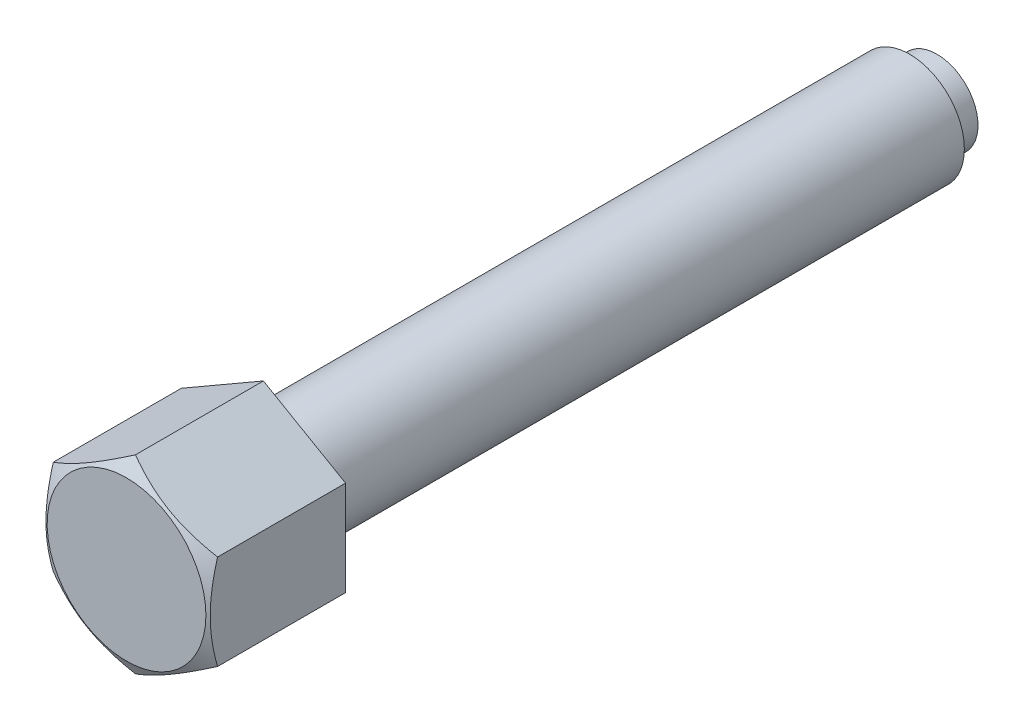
ISO-10303-21;
HEADER;
FILE_DESCRIPTION(('STEP AP214'),'2;1');
FILE_NAME('part.step','',(''),(''),'','','');
FILE_SCHEMA(('AUTOMOTIVE_DESIGN { 1 0 10303 214 1 1 1 1 }'));
ENDSEC;
DATA;
#1=APPLICATION_CONTEXT('core data for automotive mechanical design processes');
#2=APPLICATION_PROTOCOL_DEFINITION('international standard','automotive_design',2000,#1);
#3=PRODUCT_CONTEXT('',#1,'mechanical');
#4=PRODUCT('Part','Part','',(#3));
#5=PRODUCT_RELATED_PRODUCT_CATEGORY('part','',(#4));
#6=PRODUCT_DEFINITION_FORMATION('','',#4);
#7=PRODUCT_DEFINITION_CONTEXT('part definition',#1,'design');
#8=PRODUCT_DEFINITION('design','',#6,#7);
#9=PRODUCT_DEFINITION_SHAPE('','',#8);
#10=(LENGTH_UNIT() NAMED_UNIT(*) SI_UNIT(.MILLI.,.METRE.));
#11=(NAMED_UNIT(*) PLANE_ANGLE_UNIT() SI_UNIT($,.RADIAN.));
#12=(NAMED_UNIT(*) SI_UNIT($,.STERADIAN.) SOLID_ANGLE_UNIT());
#13=UNCERTAINTY_MEASURE_WITH_UNIT(LENGTH_MEASURE(1.E-05),#10,'distance_accuracy_value','');
#14=(GEOMETRIC_REPRESENTATION_CONTEXT(3) GLOBAL_UNCERTAINTY_ASSIGNED_CONTEXT((#13)) GLOBAL_UNIT_ASSIGNED_CONTEXT((#10,
#11,#12)) REPRESENTATION_CONTEXT('',''));
#15=CARTESIAN_POINT('',(0.,0.,0.));
#16=DIRECTION('',(0.,0.,1.));
#17=DIRECTION('',(1.,0.,0.));
#18=AXIS2_PLACEMENT_3D('',#15,#16,#17);
#19=CARTESIAN_POINT('',(0.,17.3205080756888,120.));
#20=DIRECTION('',(-0.5,-0.86602540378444,0.));
#21=DIRECTION('',(0.86602540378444,-0.5,0.));
#22=AXIS2_PLACEMENT_3D('',#19,#20,#21);
#23=PLANE('',#22);
#24=CARTESIAN_POINT('',(15.0002,8.66013856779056,148.371512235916));
#25=CARTESIAN_POINT('',(14.6705058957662,8.85048754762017,148.481403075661));
#26=CARTESIAN_POINT('',(14.3395258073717,9.04157899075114,148.586307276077));
#27=CARTESIAN_POINT('',(13.674911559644,9.425294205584,148.784756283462));
#28=CARTESIAN_POINT('',(13.3412765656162,9.61791845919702,148.878297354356));
#29=CARTESIAN_POINT('',(12.6707077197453,10.0050715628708,149.052762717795));
#30=CARTESIAN_POINT('',(12.333767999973,10.199603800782,149.133657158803));
#31=CARTESIAN_POINT('',(11.6575472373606,10.5900200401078,149.281092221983));
#32=CARTESIAN_POINT('',(11.3182663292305,10.7859039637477,149.347633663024));
#33=CARTESIAN_POINT('',(10.6460568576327,11.1740042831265,149.463532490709));
#34=CARTESIAN_POINT('',(10.3131781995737,11.3661918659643,149.513273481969));
#35=CARTESIAN_POINT('',(9.6458955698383,11.7514476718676,149.596678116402));
#36=CARTESIAN_POINT('',(9.31149156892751,11.9445159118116,149.630341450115));
#37=CARTESIAN_POINT('',(8.64212181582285,12.3309767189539,149.680740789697));
#38=CARTESIAN_POINT('',(8.30715720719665,12.5243686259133,149.697496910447));
#39=CARTESIAN_POINT('',(7.636918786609,12.9113309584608,149.713721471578));
#40=CARTESIAN_POINT('',(7.30164498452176,13.1049013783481,149.713190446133));
#41=CARTESIAN_POINT('',(6.67485311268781,13.4667798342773,149.696048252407));
#42=CARTESIAN_POINT('',(6.38329037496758,13.6351136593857,149.681528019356));
#43=CARTESIAN_POINT('',(5.80083556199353,13.9713941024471,149.639687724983));
#44=CARTESIAN_POINT('',(5.50994353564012,14.1393406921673,149.612366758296));
#45=CARTESIAN_POINT('',(4.92898814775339,14.4747554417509,149.545401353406));
#46=CARTESIAN_POINT('',(4.63892567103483,14.6422230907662,149.505746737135));
#47=CARTESIAN_POINT('',(4.06016058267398,14.9763732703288,149.414809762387));
#48=CARTESIAN_POINT('',(3.77145806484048,15.1430557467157,149.363526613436));
#49=CARTESIAN_POINT('',(2.89508556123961,15.6490296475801,149.190938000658));
#50=CARTESIAN_POINT('',(2.30995340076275,15.9868558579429,149.052423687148));
#51=CARTESIAN_POINT('',(1.14841408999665,16.657470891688,148.73805289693));
#52=CARTESIAN_POINT('',(0.5719920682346,16.9902683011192,148.562270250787));
#53=CARTESIAN_POINT('',(-0.00019999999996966,17.3206235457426,148.371512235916));
#54=B_SPLINE_CURVE_WITH_KNOTS('',3,(#24,#25,#26,#27,#28,#29,#30,#31,#32,#33,#34,#35,#36,#37,#38,
#39,#40,#41,#42,#43,#44,#45,#46,#47,#48,#49,#50,#51,#52,#53),.UNSPECIFIED.,.F.,.F.,(4,2,2,2,2,2,
2,2,2,2,2,2,2,2,4),(0.,1.18875411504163,2.37789802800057,3.56980778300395,4.76164951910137,
5.9240737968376,7.08652044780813,8.24758247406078,9.40860862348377,10.4193068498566,
11.4300765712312,12.4416826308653,13.4533574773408,15.5211962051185,17.5849760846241),.UNSPECIFIED.);
#55=CARTESIAN_POINT('',(15.,8.66025403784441,148.37157890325));
#56=VERTEX_POINT('',#55);
#57=CARTESIAN_POINT('',(0.,17.3205080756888,148.37157890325));
#58=VERTEX_POINT('',#57);
#59=EDGE_CURVE('E30',#56,#58,#54,.T.);
#60=ORIENTED_EDGE('',*,*,#59,.F.);
#61=DIRECTION('',(0.,0.,1.));
#62=VECTOR('',#61,1.);
#63=CARTESIAN_POINT('',(15.,8.66025403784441,120.));
#64=LINE('',#63,#62);
#65=CARTESIAN_POINT('',(15.,8.66025403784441,125.));
#66=VERTEX_POINT('',#65);
#67=EDGE_CURVE('E97',#66,#56,#64,.T.);
#68=ORIENTED_EDGE('',*,*,#67,.F.);
#69=DIRECTION('',(0.86602540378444,-0.5,0.));
#70=VECTOR('',#69,1.);
#71=CARTESIAN_POINT('',(15.,8.66025403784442,125.));
#72=LINE('',#71,#70);
#73=CARTESIAN_POINT('',(0.,17.3205080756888,125.));
#74=VERTEX_POINT('',#73);
#75=EDGE_CURVE('E111',#74,#66,#72,.T.);
#76=ORIENTED_EDGE('',*,*,#75,.F.);
#77=DIRECTION('',(0.,0.,1.));
#78=VECTOR('',#77,1.);
#79=CARTESIAN_POINT('',(0.,17.3205080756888,120.));
#80=LINE('',#79,#78);
#81=EDGE_CURVE('E37',#74,#58,#80,.T.);
#82=ORIENTED_EDGE('',*,*,#81,.T.);
#83=EDGE_LOOP('',(#60,#68,#76,#82));
#84=FACE_BOUND('',#83,.T.);
#85=ADVANCED_FACE('F15',(#84),#23,.F.);
#86=CARTESIAN_POINT('',(15.,8.66025403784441,120.));
#87=DIRECTION('',(-1.,0.,0.));
#88=DIRECTION('',(0.,-1.,0.));
#89=AXIS2_PLACEMENT_3D('',#86,#87,#88);
#90=PLANE('',#89);
#91=CARTESIAN_POINT('',(15.,-23.2589774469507,142.392634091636));
#92=CARTESIAN_POINT('',(15.,-22.9314293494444,142.551557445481));
#93=CARTESIAN_POINT('',(15.,-22.6034967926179,142.709688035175));
#94=CARTESIAN_POINT('',(15.,-21.9467825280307,143.024184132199));
#95=CARTESIAN_POINT('',(15.,-21.6180008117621,143.180549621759));
#96=CARTESIAN_POINT('',(15.,-20.6301739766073,143.646770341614));
#97=CARTESIAN_POINT('',(15.,-19.9697441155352,143.953702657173));
#98=CARTESIAN_POINT('',(15.,-18.6408678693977,144.559569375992));
#99=CARTESIAN_POINT('',(15.,-17.9723974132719,144.85845110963));
#100=CARTESIAN_POINT('',(15.,-16.6301391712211,145.443983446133));
#101=CARTESIAN_POINT('',(15.,-15.9563516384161,145.730634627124));
#102=CARTESIAN_POINT('',(15.,-14.5806535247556,146.297423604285));
#103=CARTESIAN_POINT('',(15.,-13.8785342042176,146.577057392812));
#104=CARTESIAN_POINT('',(15.,-12.4660749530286,147.115153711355));
#105=CARTESIAN_POINT('',(15.,-11.7557341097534,147.373613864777));
#106=CARTESIAN_POINT('',(15.,-10.3270555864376,147.862571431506));
#107=CARTESIAN_POINT('',(15.,-9.60873744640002,148.093125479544));
#108=CARTESIAN_POINT('',(15.,-8.16172910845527,148.518883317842));
#109=CARTESIAN_POINT('',(15.,-7.43304225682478,148.714098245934));
#110=CARTESIAN_POINT('',(15.,-6.33412285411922,148.972817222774));
#111=CARTESIAN_POINT('',(15.,-5.96783993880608,149.053200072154));
#112=CARTESIAN_POINT('',(15.,-5.23277197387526,149.20163973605));
#113=CARTESIAN_POINT('',(15.,-4.86398697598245,149.269696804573));
#114=CARTESIAN_POINT('',(15.,-4.12416838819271,149.392283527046));
#115=CARTESIAN_POINT('',(15.,-3.75313482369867,149.446813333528));
#116=CARTESIAN_POINT('',(15.,-3.0092152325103,149.541257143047));
#117=CARTESIAN_POINT('',(15.,-2.63632928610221,149.58117177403));
#118=CARTESIAN_POINT('',(15.,-1.8940909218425,149.645092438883));
#119=CARTESIAN_POINT('',(15.,-1.52475590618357,149.669299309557));
#120=CARTESIAN_POINT('',(15.,-0.785393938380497,149.702073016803));
#121=CARTESIAN_POINT('',(15.,-0.415366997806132,149.710640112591));
#122=CARTESIAN_POINT('',(15.,0.324718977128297,149.711930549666));
#123=CARTESIAN_POINT('',(15.,0.694778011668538,149.704653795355));
#124=CARTESIAN_POINT('',(15.,1.43425976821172,149.674433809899));
#125=CARTESIAN_POINT('',(15.,1.80368246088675,149.651489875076));
#126=CARTESIAN_POINT('',(15.,2.69161519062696,149.577999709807));
#127=CARTESIAN_POINT('',(15.,3.20952036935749,149.520014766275));
#128=CARTESIAN_POINT('',(15.,4.2414878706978,149.376411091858));
#129=CARTESIAN_POINT('',(15.,4.75554966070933,149.290788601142));
#130=CARTESIAN_POINT('',(15.,5.77933964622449,149.094955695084));
#131=CARTESIAN_POINT('',(15.,6.28906414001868,148.984726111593));
#132=CARTESIAN_POINT('',(15.,7.30340039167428,148.743042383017));
#133=CARTESIAN_POINT('',(15.,7.8080122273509,148.611588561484));
#134=CARTESIAN_POINT('',(15.,8.82323884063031,148.327542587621));
#135=CARTESIAN_POINT('',(15.,9.33374019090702,148.174547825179));
#136=CARTESIAN_POINT('',(15.,10.3497136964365,147.852767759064));
#137=CARTESIAN_POINT('',(15.,10.8551858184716,147.683982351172));
#138=CARTESIAN_POINT('',(15.,11.8613512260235,147.3332995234));
#139=CARTESIAN_POINT('',(15.,12.3620460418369,147.151406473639));
#140=CARTESIAN_POINT('',(15.,13.3592876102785,146.776646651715));
#141=CARTESIAN_POINT('',(15.,13.8558344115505,146.583780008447));
#142=CARTESIAN_POINT('',(15.,15.0279164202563,146.115990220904));
#143=CARTESIAN_POINT('',(15.,15.7018504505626,145.83706123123));
#144=CARTESIAN_POINT('',(15.,17.0439869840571,145.265699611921));
#145=CARTESIAN_POINT('',(15.,17.7121891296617,144.97326614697));
#146=CARTESIAN_POINT('',(15.,19.0439312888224,144.377603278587));
#147=CARTESIAN_POINT('',(15.,19.7074702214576,144.074371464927));
#148=CARTESIAN_POINT('',(15.,21.0305158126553,143.459292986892));
#149=CARTESIAN_POINT('',(15.,21.6900225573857,143.147446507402));
#150=CARTESIAN_POINT('',(15.,23.0063955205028,142.516405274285));
#151=CARTESIAN_POINT('',(15.,23.6632580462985,142.197202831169));
#152=CARTESIAN_POINT('',(15.,24.9741522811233,141.553038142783));
#153=CARTESIAN_POINT('',(15.,25.628183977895,141.228075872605));
#154=CARTESIAN_POINT('',(15.,26.9337675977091,140.573422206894));
#155=CARTESIAN_POINT('',(15.,27.5853198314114,140.24373143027));
#156=CARTESIAN_POINT('',(15.,28.8863878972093,139.580353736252));
#157=CARTESIAN_POINT('',(15.,29.5359037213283,139.24666680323));
#158=CARTESIAN_POINT('',(15.,31.3728578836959,138.296921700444));
#159=CARTESIAN_POINT('',(15.,32.5582518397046,137.676909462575));
#160=CARTESIAN_POINT('',(15.,34.9246422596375,136.428467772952));
#161=CARTESIAN_POINT('',(15.,36.1056385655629,135.800038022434));
#162=CARTESIAN_POINT('',(15.,38.4612393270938,134.538309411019));
#163=CARTESIAN_POINT('',(15.,39.6358523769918,133.905026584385));
#164=CARTESIAN_POINT('',(15.,41.3956981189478,132.95135677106));
#165=CARTESIAN_POINT('',(15.,41.981951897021,132.632851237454));
#166=CARTESIAN_POINT('',(15.,43.1538464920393,131.99471655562));
#167=CARTESIAN_POINT('',(15.,43.7394873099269,131.675087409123));
#168=CARTESIAN_POINT('',(15.,44.3248563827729,131.354961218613));
#169=B_SPLINE_CURVE_WITH_KNOTS('',3,(#91,#92,#93,#94,#95,#96,#97,#98,#99,#100,#101,#102,#103,
#104,#105,#106,#107,#108,#109,#110,#111,#112,#113,#114,#115,#116,#117,#118,#119,#120,#121,#122,
#123,#124,#125,#126,#127,#128,#129,#130,#131,#132,#133,#134,#135,#136,#137,#138,#139,#140,#141,
#142,#143,#144,#145,#146,#147,#148,#149,#150,#151,#152,#153,#154,#155,#156,#157,#158,#159,#160,
#161,#162,#163,#164,#165,#166,#167,#168),.UNSPECIFIED.,.F.,.F.,(4,2,2,2,2,2,2,2,2,2,2,2,2,2,2,2,
2,2,2,2,2,2,2,2,2,2,2,2,2,2,2,2,2,2,2,2,2,2,4),(0.,1.09219740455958,2.18440579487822,
4.36914598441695,6.56578614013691,8.76232234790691,11.0293285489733,13.2965888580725,
15.5591677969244,17.8210323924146,18.9458568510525,20.0706581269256,21.1954467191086,
22.3201869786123,23.4302473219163,24.5402892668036,25.6503379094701,26.7604364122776,
28.3229950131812,29.8857662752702,31.4497591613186,33.0137282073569,34.6122259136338,
36.2107341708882,37.80871192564,39.406670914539,41.5945970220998,43.7826586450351,
45.9712117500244,48.1597179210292,50.3506261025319,52.5415437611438,54.7321772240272,
56.9228192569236,60.9360168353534,64.9493572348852,68.9526974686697,70.9542593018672,
72.9558180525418),.UNSPECIFIED.);
#170=CARTESIAN_POINT('',(15.,-8.66025403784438,148.37157890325));
#171=VERTEX_POINT('',#170);
#172=EDGE_CURVE('E157',#171,#56,#169,.T.);
#173=ORIENTED_EDGE('',*,*,#172,.F.);
#174=DIRECTION('',(0.,0.,1.));
#175=VECTOR('',#174,1.);
#176=CARTESIAN_POINT('',(15.,-8.66025403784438,120.));
#177=LINE('',#176,#175);
#178=CARTESIAN_POINT('',(15.,-8.66025403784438,125.));
#179=VERTEX_POINT('',#178);
#180=EDGE_CURVE('E94',#179,#171,#177,.T.);
#181=ORIENTED_EDGE('',*,*,#180,.F.);
#182=DIRECTION('',(0.,-1.,0.));
#183=VECTOR('',#182,1.);
#184=CARTESIAN_POINT('',(15.,0.,125.));
#185=LINE('',#184,#183);
#186=EDGE_CURVE('E108',#66,#179,#185,.T.);
#187=ORIENTED_EDGE('',*,*,#186,.F.);
#188=ORIENTED_EDGE('',*,*,#67,.T.);
#189=EDGE_LOOP('',(#173,#181,#187,#188));
#190=FACE_BOUND('',#189,.T.);
#191=ADVANCED_FACE('F137',(#190),#90,.F.);
#192=CARTESIAN_POINT('',(0.,-17.3205080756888,120.));
#193=DIRECTION('',(0.5,-0.866025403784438,0.));
#194=DIRECTION('',(0.866025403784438,0.5,0.));
#195=AXIS2_PLACEMENT_3D('',#192,#193,#194);
#196=PLANE('',#195);
#197=ORIENTED_EDGE('',*,*,#180,.T.);
#198=CARTESIAN_POINT('',(15.0002,-8.66013856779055,148.371512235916));
#199=CARTESIAN_POINT('',(14.6705058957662,-8.85048754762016,148.481403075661));
#200=CARTESIAN_POINT('',(14.3395258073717,-9.04157899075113,148.586307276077));
#201=CARTESIAN_POINT('',(13.674911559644,-9.42529420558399,148.784756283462));
#202=CARTESIAN_POINT('',(13.3412765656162,-9.61791845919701,148.878297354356));
#203=CARTESIAN_POINT('',(12.6707077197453,-10.0050715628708,149.052762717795));
#204=CARTESIAN_POINT('',(12.333767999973,-10.199603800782,149.133657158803));
#205=CARTESIAN_POINT('',(11.6575472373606,-10.5900200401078,149.281092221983));
#206=CARTESIAN_POINT('',(11.3182663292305,-10.7859039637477,149.347633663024));
#207=CARTESIAN_POINT('',(10.6460568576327,-11.1740042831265,149.463532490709));
#208=CARTESIAN_POINT('',(10.3131781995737,-11.3661918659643,149.513273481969));
#209=CARTESIAN_POINT('',(9.64589556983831,-11.7514476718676,149.596678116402));
#210=CARTESIAN_POINT('',(9.31149156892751,-11.9445159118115,149.630341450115));
#211=CARTESIAN_POINT('',(8.64212181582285,-12.3309767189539,149.680740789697));
#212=CARTESIAN_POINT('',(8.30715720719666,-12.5243686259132,149.697496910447));
#213=CARTESIAN_POINT('',(7.636918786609,-12.9113309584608,149.713721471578));
#214=CARTESIAN_POINT('',(7.30164498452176,-13.104901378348,149.713190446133));
#215=CARTESIAN_POINT('',(6.6748531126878,-13.4667798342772,149.696048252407));
#216=CARTESIAN_POINT('',(6.38329037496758,-13.6351136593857,149.681528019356));
#217=CARTESIAN_POINT('',(5.80083556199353,-13.9713941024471,149.639687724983));
#218=CARTESIAN_POINT('',(5.50994353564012,-14.1393406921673,149.612366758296));
#219=CARTESIAN_POINT('',(4.92898814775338,-14.4747554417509,149.545401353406));
#220=CARTESIAN_POINT('',(4.63892567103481,-14.6422230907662,149.505746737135));
#221=CARTESIAN_POINT('',(4.06016058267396,-14.9763732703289,149.414809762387));
#222=CARTESIAN_POINT('',(3.77145806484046,-15.1430557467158,149.363526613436));
#223=CARTESIAN_POINT('',(2.89508556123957,-15.6490296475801,149.190938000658));
#224=CARTESIAN_POINT('',(2.30995340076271,-15.9868558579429,149.052423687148));
#225=CARTESIAN_POINT('',(1.14841408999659,-16.6574708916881,148.73805289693));
#226=CARTESIAN_POINT('',(0.571992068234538,-16.9902683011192,148.562270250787));
#227=CARTESIAN_POINT('',(-0.000200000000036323,-17.3206235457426,148.371512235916));
#228=B_SPLINE_CURVE_WITH_KNOTS('',3,(#198,#199,#200,#201,#202,#203,#204,#205,#206,#207,#208,
#209,#210,#211,#212,#213,#214,#215,#216,#217,#218,#219,#220,#221,#222,#223,#224,#225,#226,#227),
.UNSPECIFIED.,.F.,.F.,(4,2,2,2,2,2,2,2,2,2,2,2,2,2,4),(0.,1.18875411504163,2.37789802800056,
3.56980778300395,4.76164951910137,5.92407379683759,7.08652044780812,8.24758247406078,
9.40860862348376,10.4193068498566,11.4300765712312,12.4416826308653,13.4533574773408,
15.5211962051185,17.5849760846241),.UNSPECIFIED.);
#229=CARTESIAN_POINT('',(0.,-17.3205080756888,148.37157890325));
#230=VERTEX_POINT('',#229);
#231=EDGE_CURVE('E163',#171,#230,#228,.T.);
#232=ORIENTED_EDGE('',*,*,#231,.T.);
#233=DIRECTION('',(0.,0.,1.));
#234=VECTOR('',#233,1.);
#235=CARTESIAN_POINT('',(0.,-17.3205080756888,120.));
#236=LINE('',#235,#234);
#237=CARTESIAN_POINT('',(0.,-17.3205080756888,125.));
#238=VERTEX_POINT('',#237);
#239=EDGE_CURVE('E87',#238,#230,#236,.T.);
#240=ORIENTED_EDGE('',*,*,#239,.F.);
#241=DIRECTION('',(0.866025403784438,0.5,0.));
#242=VECTOR('',#241,1.);
#243=CARTESIAN_POINT('',(15.,-8.66025403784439,125.));
#244=LINE('',#243,#242);
#245=EDGE_CURVE('E106',#238,#179,#244,.T.);
#246=ORIENTED_EDGE('',*,*,#245,.T.);
#247=EDGE_LOOP('',(#197,#232,#240,#246));
#248=FACE_BOUND('',#247,.T.);
#249=ADVANCED_FACE('F143',(#248),#196,.T.);
#250=CARTESIAN_POINT('',(0.,-17.3205080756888,120.));
#251=DIRECTION('',(0.5,0.866025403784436,0.));
#252=DIRECTION('',(-0.866025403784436,0.5,0.));
#253=AXIS2_PLACEMENT_3D('',#250,#251,#252);
#254=PLANE('',#253);
#255=CARTESIAN_POINT('',(-15.0002,-8.66013856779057,148.371512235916));
#256=CARTESIAN_POINT('',(-14.6705058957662,-8.85048754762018,148.481403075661));
#257=CARTESIAN_POINT('',(-14.3395258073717,-9.04157899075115,148.586307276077));
#258=CARTESIAN_POINT('',(-13.674911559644,-9.42529420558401,148.784756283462));
#259=CARTESIAN_POINT('',(-13.3412765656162,-9.61791845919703,148.878297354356));
#260=CARTESIAN_POINT('',(-12.6707077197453,-10.0050715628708,149.052762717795));
#261=CARTESIAN_POINT('',(-12.333767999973,-10.199603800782,149.133657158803));
#262=CARTESIAN_POINT('',(-11.6575472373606,-10.5900200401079,149.281092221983));
#263=CARTESIAN_POINT('',(-11.3182663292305,-10.7859039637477,149.347633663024));
#264=CARTESIAN_POINT('',(-10.6460568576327,-11.1740042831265,149.463532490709));
#265=CARTESIAN_POINT('',(-10.3131781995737,-11.3661918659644,149.513273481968));
#266=CARTESIAN_POINT('',(-9.64589556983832,-11.7514476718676,149.596678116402));
#267=CARTESIAN_POINT('',(-9.31149156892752,-11.9445159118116,149.630341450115));
#268=CARTESIAN_POINT('',(-8.64212181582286,-12.3309767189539,149.680740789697));
#269=CARTESIAN_POINT('',(-8.30715720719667,-12.5243686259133,149.697496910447));
#270=CARTESIAN_POINT('',(-7.63691878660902,-12.9113309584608,149.713721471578));
#271=CARTESIAN_POINT('',(-7.30164498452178,-13.1049013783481,149.713190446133));
#272=CARTESIAN_POINT('',(-6.67485311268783,-13.4667798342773,149.696048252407));
#273=CARTESIAN_POINT('',(-6.38329037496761,-13.6351136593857,149.681528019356));
#274=CARTESIAN_POINT('',(-5.80083556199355,-13.9713941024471,149.639687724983));
#275=CARTESIAN_POINT('',(-5.50994353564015,-14.1393406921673,149.612366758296));
#276=CARTESIAN_POINT('',(-4.92898814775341,-14.4747554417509,149.545401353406));
#277=CARTESIAN_POINT('',(-4.63892567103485,-14.6422230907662,149.505746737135));
#278=CARTESIAN_POINT('',(-4.060160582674,-14.9763732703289,149.414809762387));
#279=CARTESIAN_POINT('',(-3.7714580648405,-15.1430557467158,149.363526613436));
#280=CARTESIAN_POINT('',(-2.89508556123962,-15.6490296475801,149.190938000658));
#281=CARTESIAN_POINT('',(-2.30995340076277,-15.9868558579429,149.052423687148));
#282=CARTESIAN_POINT('',(-1.14841408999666,-16.6574708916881,148.73805289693));
#283=CARTESIAN_POINT('',(-0.571992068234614,-16.9902683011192,148.562270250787));
#284=CARTESIAN_POINT('',(0.000199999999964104,-17.3206235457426,148.371512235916));
#285=B_SPLINE_CURVE_WITH_KNOTS('',3,(#255,#256,#257,#258,#259,#260,#261,#262,#263,#264,#265,
#266,#267,#268,#269,#270,#271,#272,#273,#274,#275,#276,#277,#278,#279,#280,#281,#282,#283,#284),
.UNSPECIFIED.,.F.,.F.,(4,2,2,2,2,2,2,2,2,2,2,2,2,2,4),(0.,1.18875411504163,2.37789802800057,
3.56980778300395,4.76164951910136,5.92407379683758,7.08652044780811,8.24758247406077,
9.40860862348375,10.4193068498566,11.4300765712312,12.4416826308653,13.4533574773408,
15.5211962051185,17.5849760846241),.UNSPECIFIED.);
#286=CARTESIAN_POINT('',(-15.,-8.66025403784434,148.37157890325));
#287=VERTEX_POINT('',#286);
#288=EDGE_CURVE('E81',#287,#230,#285,.T.);
#289=ORIENTED_EDGE('',*,*,#288,.F.);
#290=DIRECTION('',(0.,0.,1.));
#291=VECTOR('',#290,1.);
#292=CARTESIAN_POINT('',(-15.,-8.66025403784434,120.));
#293=LINE('',#292,#291);
#294=CARTESIAN_POINT('',(-15.,-8.66025403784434,125.));
#295=VERTEX_POINT('',#294);
#296=EDGE_CURVE('E80',#295,#287,#293,.T.);
#297=ORIENTED_EDGE('',*,*,#296,.F.);
#298=DIRECTION('',(-0.866025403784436,0.5,0.));
#299=VECTOR('',#298,1.);
#300=CARTESIAN_POINT('',(-1.17961196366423E-13,-17.3205080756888,125.));
#301=LINE('',#300,#299);
#302=EDGE_CURVE('E103',#238,#295,#301,.T.);
#303=ORIENTED_EDGE('',*,*,#302,.F.);
#304=ORIENTED_EDGE('',*,*,#239,.T.);
#305=EDGE_LOOP('',(#289,#297,#303,#304));
#306=FACE_BOUND('',#305,.T.);
#307=ADVANCED_FACE('F239',(#306),#254,.F.);
#308=CARTESIAN_POINT('',(-15.,8.66025403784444,120.));
#309=DIRECTION('',(-1.,0.,0.));
#310=DIRECTION('',(0.,0.,1.));
#311=AXIS2_PLACEMENT_3D('',#308,#309,#310);
#312=PLANE('',#311);
#313=ORIENTED_EDGE('',*,*,#296,.T.);
#314=CARTESIAN_POINT('',(-15.,-23.2589774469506,142.392634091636));
#315=CARTESIAN_POINT('',(-15.,-22.9314293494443,142.551557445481));
#316=CARTESIAN_POINT('',(-15.,-22.6034967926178,142.709688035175));
#317=CARTESIAN_POINT('',(-15.,-21.9467825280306,143.024184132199));
#318=CARTESIAN_POINT('',(-15.,-21.618000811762,143.180549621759));
#319=CARTESIAN_POINT('',(-15.,-20.6301739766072,143.646770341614));
#320=CARTESIAN_POINT('',(-15.,-19.9697441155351,143.953702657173));
#321=CARTESIAN_POINT('',(-15.,-18.6408678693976,144.559569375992));
#322=CARTESIAN_POINT('',(-15.,-17.9723974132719,144.85845110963));
#323=CARTESIAN_POINT('',(-15.,-16.630139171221,145.443983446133));
#324=CARTESIAN_POINT('',(-15.,-15.956351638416,145.730634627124));
#325=CARTESIAN_POINT('',(-15.,-14.5806535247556,146.297423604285));
#326=CARTESIAN_POINT('',(-15.,-13.8785342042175,146.577057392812));
#327=CARTESIAN_POINT('',(-15.,-12.4660749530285,147.115153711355));
#328=CARTESIAN_POINT('',(-15.,-11.7557341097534,147.373613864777));
#329=CARTESIAN_POINT('',(-15.,-10.3270555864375,147.862571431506));
#330=CARTESIAN_POINT('',(-15.,-9.60873744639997,148.093125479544));
#331=CARTESIAN_POINT('',(-15.,-8.16172910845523,148.518883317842));
#332=CARTESIAN_POINT('',(-15.,-7.43304225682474,148.714098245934));
#333=CARTESIAN_POINT('',(-15.,-6.33412285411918,148.972817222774));
#334=CARTESIAN_POINT('',(-15.,-5.96783993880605,149.053200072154));
#335=CARTESIAN_POINT('',(-15.,-5.23277197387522,149.20163973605));
#336=CARTESIAN_POINT('',(-15.,-4.86398697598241,149.269696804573));
#337=CARTESIAN_POINT('',(-15.,-4.12416838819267,149.392283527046));
#338=CARTESIAN_POINT('',(-15.,-3.75313482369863,149.446813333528));
#339=CARTESIAN_POINT('',(-15.,-3.00921523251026,149.541257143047));
#340=CARTESIAN_POINT('',(-15.,-2.63632928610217,149.58117177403));
#341=CARTESIAN_POINT('',(-15.,-1.89409092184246,149.645092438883));
#342=CARTESIAN_POINT('',(-15.,-1.52475590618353,149.669299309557));
#343=CARTESIAN_POINT('',(-15.,-0.785393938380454,149.702073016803));
#344=CARTESIAN_POINT('',(-15.,-0.415366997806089,149.710640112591));
#345=CARTESIAN_POINT('',(-15.,0.324718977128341,149.711930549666));
#346=CARTESIAN_POINT('',(-15.,0.694778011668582,149.704653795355));
#347=CARTESIAN_POINT('',(-15.,1.43425976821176,149.674433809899));
#348=CARTESIAN_POINT('',(-15.,1.80368246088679,149.651489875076));
#349=CARTESIAN_POINT('',(-15.,2.69161519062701,149.577999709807));
#350=CARTESIAN_POINT('',(-15.,3.20952036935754,149.520014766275));
#351=CARTESIAN_POINT('',(-15.,4.24148787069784,149.376411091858));
#352=CARTESIAN_POINT('',(-15.,4.75554966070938,149.290788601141));
#353=CARTESIAN_POINT('',(-15.,5.77933964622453,149.094955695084));
#354=CARTESIAN_POINT('',(-15.,6.28906414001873,148.984726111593));
#355=CARTESIAN_POINT('',(-15.,7.30340039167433,148.743042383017));
#356=CARTESIAN_POINT('',(-15.,7.80801222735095,148.611588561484));
#357=CARTESIAN_POINT('',(-15.,8.82323884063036,148.327542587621));
#358=CARTESIAN_POINT('',(-15.,9.33374019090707,148.174547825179));
#359=CARTESIAN_POINT('',(-15.,10.3497136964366,147.852767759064));
#360=CARTESIAN_POINT('',(-15.,10.8551858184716,147.683982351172));
#361=CARTESIAN_POINT('',(-15.,11.8613512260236,147.3332995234));
#362=CARTESIAN_POINT('',(-15.,12.3620460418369,147.151406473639));
#363=CARTESIAN_POINT('',(-15.,13.3592876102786,146.776646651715));
#364=CARTESIAN_POINT('',(-15.,13.8558344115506,146.583780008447));
#365=CARTESIAN_POINT('',(-15.,15.0279164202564,146.115990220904));
#366=CARTESIAN_POINT('',(-15.,15.7018504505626,145.83706123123));
#367=CARTESIAN_POINT('',(-15.,17.0439869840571,145.265699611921));
#368=CARTESIAN_POINT('',(-15.,17.7121891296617,144.97326614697));
#369=CARTESIAN_POINT('',(-15.,19.0439312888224,144.377603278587));
#370=CARTESIAN_POINT('',(-15.,19.7074702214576,144.074371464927));
#371=CARTESIAN_POINT('',(-15.,21.0305158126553,143.459292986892));
#372=CARTESIAN_POINT('',(-15.,21.6900225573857,143.147446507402));
#373=CARTESIAN_POINT('',(-15.,23.0063955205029,142.516405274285));
#374=CARTESIAN_POINT('',(-15.,23.6632580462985,142.197202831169));
#375=CARTESIAN_POINT('',(-15.,24.9741522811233,141.553038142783));
#376=CARTESIAN_POINT('',(-15.,25.6281839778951,141.228075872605));
#377=CARTESIAN_POINT('',(-15.,26.9337675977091,140.573422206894));
#378=CARTESIAN_POINT('',(-15.,27.5853198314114,140.24373143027));
#379=CARTESIAN_POINT('',(-15.,28.8863878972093,139.580353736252));
#380=CARTESIAN_POINT('',(-15.,29.5359037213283,139.24666680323));
#381=CARTESIAN_POINT('',(-15.,31.3728578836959,138.296921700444));
#382=CARTESIAN_POINT('',(-15.,32.5582518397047,137.676909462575));
#383=CARTESIAN_POINT('',(-15.,34.9246422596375,136.428467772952));
#384=CARTESIAN_POINT('',(-15.,36.1056385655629,135.800038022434));
#385=CARTESIAN_POINT('',(-15.,38.4612393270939,134.538309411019));
#386=CARTESIAN_POINT('',(-15.,39.6358523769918,133.905026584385));
#387=CARTESIAN_POINT('',(-15.,41.3956981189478,132.95135677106));
#388=CARTESIAN_POINT('',(-15.,41.981951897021,132.632851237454));
#389=CARTESIAN_POINT('',(-15.,43.1538464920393,131.99471655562));
#390=CARTESIAN_POINT('',(-15.,43.739487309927,131.675087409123));
#391=CARTESIAN_POINT('',(-15.,44.3248563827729,131.354961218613));
#392=B_SPLINE_CURVE_WITH_KNOTS('',3,(#314,#315,#316,#317,#318,#319,#320,#321,#322,#323,#324,
#325,#326,#327,#328,#329,#330,#331,#332,#333,#334,#335,#336,#337,#338,#339,#340,#341,#342,#343,
#344,#345,#346,#347,#348,#349,#350,#351,#352,#353,#354,#355,#356,#357,#358,#359,#360,#361,#362,
#363,#364,#365,#366,#367,#368,#369,#370,#371,#372,#373,#374,#375,#376,#377,#378,#379,#380,#381,
#382,#383,#384,#385,#386,#387,#388,#389,#390,#391),.UNSPECIFIED.,.F.,.F.,(4,2,2,2,2,2,2,2,2,2,2,
2,2,2,2,2,2,2,2,2,2,2,2,2,2,2,2,2,2,2,2,2,2,2,2,2,2,2,4),(0.,1.09219740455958,2.18440579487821,
4.36914598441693,6.56578614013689,8.7623223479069,11.0293285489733,13.2965888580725,
15.5591677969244,17.8210323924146,18.9458568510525,20.0706581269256,21.1954467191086,
22.3201869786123,23.4302473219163,24.5402892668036,25.6503379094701,26.7604364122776,
28.3229950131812,29.8857662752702,31.4497591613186,33.0137282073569,34.6122259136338,
36.2107341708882,37.80871192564,39.406670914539,41.5945970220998,43.7826586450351,
45.9712117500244,48.1597179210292,50.3506261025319,52.5415437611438,54.7321772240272,
56.9228192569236,60.9360168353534,64.9493572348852,68.9526974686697,70.9542593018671,
72.9558180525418),.UNSPECIFIED.);
#393=CARTESIAN_POINT('',(-15.,8.66025403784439,148.37157890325));
#394=VERTEX_POINT('',#393);
#395=EDGE_CURVE('E68',#287,#394,#392,.T.);
#396=ORIENTED_EDGE('',*,*,#395,.T.);
#397=DIRECTION('',(0.,0.,1.));
#398=VECTOR('',#397,1.);
#399=CARTESIAN_POINT('',(-15.,8.66025403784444,120.));
#400=LINE('',#399,#398);
#401=CARTESIAN_POINT('',(-15.,8.66025403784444,125.));
#402=VERTEX_POINT('',#401);
#403=EDGE_CURVE('E77',#402,#394,#400,.T.);
#404=ORIENTED_EDGE('',*,*,#403,.F.);
#405=DIRECTION('',(0.,-1.,0.));
#406=VECTOR('',#405,1.);
#407=CARTESIAN_POINT('',(-15.,0.,125.));
#408=LINE('',#407,#406);
#409=EDGE_CURVE('E101',#402,#295,#408,.T.);
#410=ORIENTED_EDGE('',*,*,#409,.T.);
#411=EDGE_LOOP('',(#313,#396,#404,#410));
#412=FACE_BOUND('',#411,.T.);
#413=ADVANCED_FACE('F76',(#412),#312,.T.);
#414=CARTESIAN_POINT('',(0.,17.3205080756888,120.));
#415=DIRECTION('',(-0.5,0.866025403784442,0.));
#416=DIRECTION('',(-0.866025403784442,-0.5,0.));
#417=AXIS2_PLACEMENT_3D('',#414,#415,#416);
#418=PLANE('',#417);
#419=ORIENTED_EDGE('',*,*,#403,.T.);
#420=CARTESIAN_POINT('',(-15.0002,8.66013856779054,148.371512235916));
#421=CARTESIAN_POINT('',(-14.6705058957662,8.85048754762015,148.481403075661));
#422=CARTESIAN_POINT('',(-14.3395258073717,9.04157899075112,148.586307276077));
#423=CARTESIAN_POINT('',(-13.674911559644,9.42529420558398,148.784756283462));
#424=CARTESIAN_POINT('',(-13.3412765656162,9.617918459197,148.878297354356));
#425=CARTESIAN_POINT('',(-12.6707077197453,10.0050715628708,149.052762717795));
#426=CARTESIAN_POINT('',(-12.333767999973,10.199603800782,149.133657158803));
#427=CARTESIAN_POINT('',(-11.6575472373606,10.5900200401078,149.281092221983));
#428=CARTESIAN_POINT('',(-11.3182663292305,10.7859039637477,149.347633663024));
#429=CARTESIAN_POINT('',(-10.6460568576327,11.1740042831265,149.463532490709));
#430=CARTESIAN_POINT('',(-10.3131781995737,11.3661918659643,149.513273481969));
#431=CARTESIAN_POINT('',(-9.64589556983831,11.7514476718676,149.596678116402));
#432=CARTESIAN_POINT('',(-9.31149156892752,11.9445159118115,149.630341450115));
#433=CARTESIAN_POINT('',(-8.64212181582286,12.3309767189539,149.680740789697));
#434=CARTESIAN_POINT('',(-8.30715720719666,12.5243686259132,149.697496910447));
#435=CARTESIAN_POINT('',(-7.636918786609,12.9113309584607,149.713721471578));
#436=CARTESIAN_POINT('',(-7.30164498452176,13.104901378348,149.713190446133));
#437=CARTESIAN_POINT('',(-6.6748531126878,13.4667798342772,149.696048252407));
#438=CARTESIAN_POINT('',(-6.38329037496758,13.6351136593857,149.681528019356));
#439=CARTESIAN_POINT('',(-5.80083556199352,13.971394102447,149.639687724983));
#440=CARTESIAN_POINT('',(-5.50994353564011,14.1393406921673,149.612366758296));
#441=CARTESIAN_POINT('',(-4.92898814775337,14.4747554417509,149.545401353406));
#442=CARTESIAN_POINT('',(-4.63892567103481,14.6422230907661,149.505746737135));
#443=CARTESIAN_POINT('',(-4.06016058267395,14.9763732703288,149.414809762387));
#444=CARTESIAN_POINT('',(-3.77145806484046,15.1430557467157,149.363526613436));
#445=CARTESIAN_POINT('',(-2.89508556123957,15.6490296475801,149.190938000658));
#446=CARTESIAN_POINT('',(-2.30995340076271,15.9868558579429,149.052423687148));
#447=CARTESIAN_POINT('',(-1.1484140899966,16.657470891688,148.73805289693));
#448=CARTESIAN_POINT('',(-0.571992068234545,16.9902683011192,148.562270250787));
#449=CARTESIAN_POINT('',(0.000200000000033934,17.3206235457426,148.371512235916));
#450=B_SPLINE_CURVE_WITH_KNOTS('',3,(#420,#421,#422,#423,#424,#425,#426,#427,#428,#429,#430,
#431,#432,#433,#434,#435,#436,#437,#438,#439,#440,#441,#442,#443,#444,#445,#446,#447,#448,#449),
.UNSPECIFIED.,.F.,.F.,(4,2,2,2,2,2,2,2,2,2,2,2,2,2,4),(0.,1.18875411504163,2.37789802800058,
3.56980778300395,4.76164951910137,5.92407379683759,7.08652044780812,8.24758247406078,
9.40860862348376,10.4193068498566,11.4300765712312,12.4416826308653,13.4533574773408,
15.5211962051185,17.5849760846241),.UNSPECIFIED.);
#451=EDGE_CURVE('E65',#394,#58,#450,.T.);
#452=ORIENTED_EDGE('',*,*,#451,.T.);
#453=ORIENTED_EDGE('',*,*,#81,.F.);
#454=DIRECTION('',(-0.866025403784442,-0.5,0.));
#455=VECTOR('',#454,1.);
#456=CARTESIAN_POINT('',(1.16226472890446E-13,17.3205080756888,125.));
#457=LINE('',#456,#455);
#458=EDGE_CURVE('E85',#74,#402,#457,.T.);
#459=ORIENTED_EDGE('',*,*,#458,.T.);
#460=EDGE_LOOP('',(#419,#452,#453,#459));
#461=FACE_BOUND('',#460,.T.);
#462=ADVANCED_FACE('F83',(#461),#418,.T.);
#463=CARTESIAN_POINT('',(0.,0.,15.));
#464=DIRECTION('',(0.,0.,1.));
#465=DIRECTION('',(1.,0.,0.));
#466=AXIS2_PLACEMENT_3D('',#463,#464,#465);
#467=SPHERICAL_SURFACE('',#466,15.);
#468=CARTESIAN_POINT('',(0.,0.,2.00961894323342));
#469=DIRECTION('',(0.,0.,1.));
#470=DIRECTION('',(1.,0.,0.));
#471=AXIS2_PLACEMENT_3D('',#468,#469,#470);
#472=CIRCLE('',#471,7.5);
#473=CARTESIAN_POINT('',(7.5,0.,2.00961894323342));
#474=VERTEX_POINT('',#473);
#475=EDGE_CURVE('E9',#474,#474,#472,.T.);
#476=ORIENTED_EDGE('',*,*,#475,.F.);
#477=EDGE_LOOP('',(#476));
#478=FACE_BOUND('',#477,.T.);
#479=ADVANCED_FACE('F17',(#478),#467,.T.);
#480=CARTESIAN_POINT('',(0.,0.,110.));
#481=DIRECTION('',(0.,0.,1.));
#482=DIRECTION('',(1.,0.,0.));
#483=AXIS2_PLACEMENT_3D('',#480,#481,#482);
#484=CYLINDRICAL_SURFACE('',#483,7.5);
#485=ORIENTED_EDGE('',*,*,#475,.T.);
#486=EDGE_LOOP('',(#485));
#487=FACE_BOUND('',#486,.T.);
#488=CARTESIAN_POINT('',(0.,0.,7.));
#489=DIRECTION('',(0.,0.,1.));
#490=DIRECTION('',(1.,0.,0.));
#491=AXIS2_PLACEMENT_3D('',#488,#489,#490);
#492=CIRCLE('',#491,7.5);
#493=CARTESIAN_POINT('',(7.5,0.,7.));
#494=VERTEX_POINT('',#493);
#495=EDGE_CURVE('E23',#494,#494,#492,.T.);
#496=ORIENTED_EDGE('',*,*,#495,.F.);
#497=EDGE_LOOP('',(#496));
#498=FACE_BOUND('',#497,.T.);
#499=ADVANCED_FACE('F124',(#487,#498),#484,.T.);
#500=CARTESIAN_POINT('',(7.5,0.,7.));
#501=DIRECTION('',(0.,0.,1.));
#502=DIRECTION('',(1.,0.,0.));
#503=AXIS2_PLACEMENT_3D('',#500,#501,#502);
#504=PLANE('',#503);
#505=CARTESIAN_POINT('',(0.,0.,7.));
#506=DIRECTION('',(0.,0.,1.));
#507=DIRECTION('',(1.,0.,0.));
#508=AXIS2_PLACEMENT_3D('',#505,#506,#507);
#509=CIRCLE('',#508,10.);
#510=CARTESIAN_POINT('',(10.,0.,7.));
#511=VERTEX_POINT('',#510);
#512=EDGE_CURVE('E117',#511,#511,#509,.T.);
#513=ORIENTED_EDGE('',*,*,#512,.F.);
#514=EDGE_LOOP('',(#513));
#515=FACE_BOUND('',#514,.T.);
#516=ORIENTED_EDGE('',*,*,#495,.T.);
#517=EDGE_LOOP('',(#516));
#518=FACE_BOUND('',#517,.T.);
#519=ADVANCED_FACE('F122',(#515,#518),#504,.F.);
#520=CARTESIAN_POINT('',(0.,0.,110.));
#521=DIRECTION('',(0.,0.,1.));
#522=DIRECTION('',(1.,0.,0.));
#523=AXIS2_PLACEMENT_3D('',#520,#521,#522);
#524=CYLINDRICAL_SURFACE('',#523,10.);
#525=CARTESIAN_POINT('',(0.,0.,125.));
#526=DIRECTION('',(0.,0.,1.));
#527=DIRECTION('',(1.,0.,0.));
#528=AXIS2_PLACEMENT_3D('',#525,#526,#527);
#529=CIRCLE('',#528,10.);
#530=CARTESIAN_POINT('',(10.,0.,125.));
#531=VERTEX_POINT('',#530);
#532=EDGE_CURVE('E114',#531,#531,#529,.T.);
#533=ORIENTED_EDGE('',*,*,#532,.F.);
#534=EDGE_LOOP('',(#533));
#535=FACE_BOUND('',#534,.T.);
#536=ORIENTED_EDGE('',*,*,#512,.T.);
#537=EDGE_LOOP('',(#536));
#538=FACE_BOUND('',#537,.T.);
#539=ADVANCED_FACE('F132',(#535,#538),#524,.T.);
#540=CARTESIAN_POINT('',(10.,0.,125.));
#541=DIRECTION('',(0.,0.,1.));
#542=DIRECTION('',(1.,0.,0.));
#543=AXIS2_PLACEMENT_3D('',#540,#541,#542);
#544=PLANE('',#543);
#545=ORIENTED_EDGE('',*,*,#458,.F.);
#546=ORIENTED_EDGE('',*,*,#75,.T.);
#547=ORIENTED_EDGE('',*,*,#186,.T.);
#548=ORIENTED_EDGE('',*,*,#245,.F.);
#549=ORIENTED_EDGE('',*,*,#302,.T.);
#550=ORIENTED_EDGE('',*,*,#409,.F.);
#551=EDGE_LOOP('',(#545,#546,#547,#548,#549,#550));
#552=FACE_BOUND('',#551,.T.);
#553=ORIENTED_EDGE('',*,*,#532,.T.);
#554=EDGE_LOOP('',(#553));
#555=FACE_BOUND('',#554,.T.);
#556=ADVANCED_FACE('F178',(#552,#555),#544,.F.);
#557=CARTESIAN_POINT('',(0.,0.,150.));
#558=DIRECTION('',(0.,0.,-1.));
#559=DIRECTION('',(-1.,0.,0.));
#560=AXIS2_PLACEMENT_3D('',#557,#558,#559);
#561=CONICAL_SURFACE('',#560,14.5,1.04719755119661);
#562=CARTESIAN_POINT('',(0.,0.,150.));
#563=DIRECTION('',(0.,0.,1.));
#564=DIRECTION('',(1.,0.,0.));
#565=AXIS2_PLACEMENT_3D('',#562,#563,#564);
#566=CIRCLE('',#565,14.5);
#567=CARTESIAN_POINT('',(14.5,0.,150.));
#568=VERTEX_POINT('',#567);
#569=EDGE_CURVE('E71',#568,#568,#566,.T.);
#570=ORIENTED_EDGE('',*,*,#569,.F.);
#571=EDGE_LOOP('',(#570));
#572=FACE_BOUND('',#571,.T.);
#573=ORIENTED_EDGE('',*,*,#59,.T.);
#574=ORIENTED_EDGE('',*,*,#451,.F.);
#575=ORIENTED_EDGE('',*,*,#395,.F.);
#576=ORIENTED_EDGE('',*,*,#288,.T.);
#577=ORIENTED_EDGE('',*,*,#231,.F.);
#578=ORIENTED_EDGE('',*,*,#172,.T.);
#579=EDGE_LOOP('',(#573,#574,#575,#576,#577,#578));
#580=FACE_BOUND('',#579,.T.);
#581=ADVANCED_FACE('F67',(#572,#580),#561,.T.);
#582=CARTESIAN_POINT('',(0.,0.,150.));
#583=DIRECTION('',(0.,0.,1.));
#584=DIRECTION('',(1.,0.,0.));
#585=AXIS2_PLACEMENT_3D('',#582,#583,#584);
#586=PLANE('',#585);
#587=ORIENTED_EDGE('',*,*,#569,.T.);
#588=EDGE_LOOP('',(#587));
#589=FACE_BOUND('',#588,.T.);
#590=ADVANCED_FACE('F174',(#589),#586,.T.);
#591=CLOSED_SHELL('',(#85,#191,#249,#307,#413,#462,#479,#499,#519,#539,#556,#581,#590));
#592=MANIFOLD_SOLID_BREP('B1',#591);
#593=ADVANCED_BREP_SHAPE_REPRESENTATION('',(#18,#592),#14);
#594=SHAPE_DEFINITION_REPRESENTATION(#9,#593);
ENDSEC;
END-ISO-10303-21;
